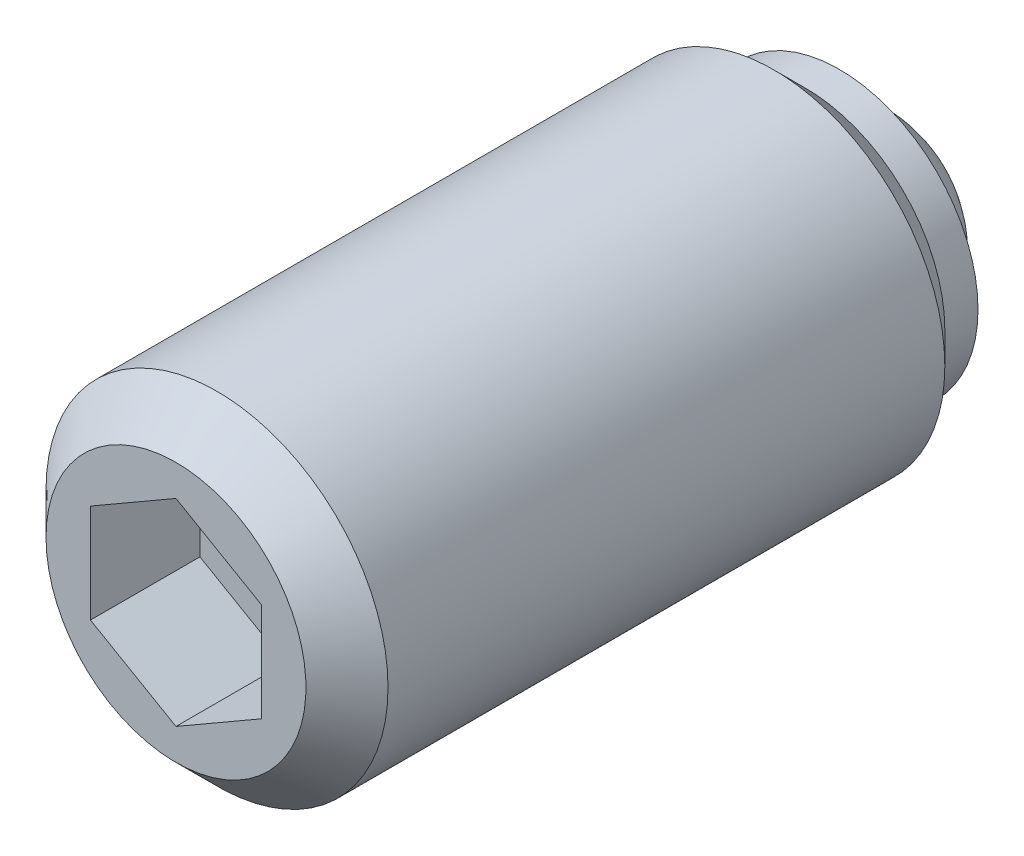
ISO-10303-21;
HEADER;
FILE_DESCRIPTION(('STEP AP214'),'2;1');
FILE_NAME('part.step','',(''),(''),'','','');
FILE_SCHEMA(('AUTOMOTIVE_DESIGN { 1 0 10303 214 1 1 1 1 }'));
ENDSEC;
DATA;
#1=APPLICATION_CONTEXT('core data for automotive mechanical design processes');
#2=APPLICATION_PROTOCOL_DEFINITION('international standard','automotive_design',2000,#1);
#3=PRODUCT_CONTEXT('',#1,'mechanical');
#4=PRODUCT('Part','Part','',(#3));
#5=PRODUCT_RELATED_PRODUCT_CATEGORY('part','',(#4));
#6=PRODUCT_DEFINITION_FORMATION('','',#4);
#7=PRODUCT_DEFINITION_CONTEXT('part definition',#1,'design');
#8=PRODUCT_DEFINITION('design','',#6,#7);
#9=PRODUCT_DEFINITION_SHAPE('','',#8);
#10=(LENGTH_UNIT() NAMED_UNIT(*) SI_UNIT(.MILLI.,.METRE.));
#11=(NAMED_UNIT(*) PLANE_ANGLE_UNIT() SI_UNIT($,.RADIAN.));
#12=(NAMED_UNIT(*) SI_UNIT($,.STERADIAN.) SOLID_ANGLE_UNIT());
#13=UNCERTAINTY_MEASURE_WITH_UNIT(LENGTH_MEASURE(1.E-05),#10,'distance_accuracy_value','');
#14=(GEOMETRIC_REPRESENTATION_CONTEXT(3) GLOBAL_UNCERTAINTY_ASSIGNED_CONTEXT((#13)) GLOBAL_UNIT_ASSIGNED_CONTEXT((#10,
#11,#12)) REPRESENTATION_CONTEXT('',''));
#15=CARTESIAN_POINT('',(0.,0.,0.));
#16=DIRECTION('',(0.,0.,1.));
#17=DIRECTION('',(1.,0.,0.));
#18=AXIS2_PLACEMENT_3D('',#15,#16,#17);
#19=CARTESIAN_POINT('',(0.,0.,18.5));
#20=DIRECTION('',(0.,0.,-1.));
#21=DIRECTION('',(-1.,0.,0.));
#22=AXIS2_PLACEMENT_3D('',#19,#20,#21);
#23=PLANE('',#22);
#24=DIRECTION('',(0.,1.,0.));
#25=VECTOR('',#24,1.);
#26=CARTESIAN_POINT('',(-2.5,-1.44337567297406,18.5));
#27=LINE('',#26,#25);
#28=CARTESIAN_POINT('',(-2.5,-1.44337567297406,18.5));
#29=VERTEX_POINT('',#28);
#30=CARTESIAN_POINT('',(-2.5,1.44337567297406,18.5));
#31=VERTEX_POINT('',#30);
#32=EDGE_CURVE('E80',#29,#31,#27,.T.);
#33=ORIENTED_EDGE('',*,*,#32,.F.);
#34=DIRECTION('',(0.866025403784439,-0.5,0.));
#35=VECTOR('',#34,1.);
#36=CARTESIAN_POINT('',(0.,-2.88675134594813,18.5));
#37=LINE('',#36,#35);
#38=CARTESIAN_POINT('',(0.,-2.88675134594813,18.5));
#39=VERTEX_POINT('',#38);
#40=EDGE_CURVE('E102',#39,#29,#37,.F.);
#41=ORIENTED_EDGE('',*,*,#40,.F.);
#42=DIRECTION('',(-0.866025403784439,-0.5,0.));
#43=VECTOR('',#42,1.);
#44=CARTESIAN_POINT('',(1.25,-2.1650635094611,18.5));
#45=LINE('',#44,#43);
#46=CARTESIAN_POINT('',(2.5,-1.44337567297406,18.5));
#47=VERTEX_POINT('',#46);
#48=EDGE_CURVE('E81',#47,#39,#45,.T.);
#49=ORIENTED_EDGE('',*,*,#48,.F.);
#50=DIRECTION('',(0.,1.,0.));
#51=VECTOR('',#50,1.);
#52=CARTESIAN_POINT('',(2.5,0.,18.5));
#53=LINE('',#52,#51);
#54=CARTESIAN_POINT('',(2.5,1.44337567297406,18.5));
#55=VERTEX_POINT('',#54);
#56=EDGE_CURVE('E64',#55,#47,#53,.F.);
#57=ORIENTED_EDGE('',*,*,#56,.F.);
#58=DIRECTION('',(0.866025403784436,-0.5,0.));
#59=VECTOR('',#58,1.);
#60=CARTESIAN_POINT('',(1.25,2.1650635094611,18.5));
#61=LINE('',#60,#59);
#62=CARTESIAN_POINT('',(0.,2.88675134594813,18.5));
#63=VERTEX_POINT('',#62);
#64=EDGE_CURVE('E67',#63,#55,#61,.T.);
#65=ORIENTED_EDGE('',*,*,#64,.F.);
#66=DIRECTION('',(0.866025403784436,0.5,0.));
#67=VECTOR('',#66,1.);
#68=CARTESIAN_POINT('',(-2.5,1.44337567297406,18.5));
#69=LINE('',#68,#67);
#70=EDGE_CURVE('E69',#31,#63,#69,.T.);
#71=ORIENTED_EDGE('',*,*,#70,.F.);
#72=EDGE_LOOP('',(#33,#41,#49,#57,#65,#71));
#73=FACE_BOUND('',#72,.T.);
#74=ADVANCED_FACE('F14',(#73),#23,.F.);
#75=CARTESIAN_POINT('',(-2.5,-1.44337567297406,18.5));
#76=DIRECTION('',(1.,0.,0.));
#77=DIRECTION('',(0.,0.,-1.));
#78=AXIS2_PLACEMENT_3D('',#75,#76,#77);
#79=PLANE('',#78);
#80=ORIENTED_EDGE('',*,*,#32,.T.);
#81=DIRECTION('',(0.,0.,-1.));
#82=VECTOR('',#81,1.);
#83=CARTESIAN_POINT('',(-2.5,1.44337567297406,18.5));
#84=LINE('',#83,#82);
#85=CARTESIAN_POINT('',(-2.5,1.44337567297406,21.7));
#86=VERTEX_POINT('',#85);
#87=EDGE_CURVE('E79',#86,#31,#84,.T.);
#88=ORIENTED_EDGE('',*,*,#87,.F.);
#89=DIRECTION('',(0.,1.,0.));
#90=VECTOR('',#89,1.);
#91=CARTESIAN_POINT('',(-2.5,0.,21.7));
#92=LINE('',#91,#90);
#93=CARTESIAN_POINT('',(-2.5,-1.44337567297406,21.7));
#94=VERTEX_POINT('',#93);
#95=EDGE_CURVE('E84',#86,#94,#92,.F.);
#96=ORIENTED_EDGE('',*,*,#95,.T.);
#97=DIRECTION('',(0.,0.,-1.));
#98=VECTOR('',#97,1.);
#99=CARTESIAN_POINT('',(-2.5,-1.44337567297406,18.5));
#100=LINE('',#99,#98);
#101=EDGE_CURVE('E96',#29,#94,#100,.F.);
#102=ORIENTED_EDGE('',*,*,#101,.F.);
#103=EDGE_LOOP('',(#80,#88,#96,#102));
#104=FACE_BOUND('',#103,.T.);
#105=ADVANCED_FACE('F169',(#104),#79,.T.);
#106=CARTESIAN_POINT('',(0.,-2.88675134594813,18.5));
#107=DIRECTION('',(0.5,0.866025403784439,0.));
#108=DIRECTION('',(0.866025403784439,-0.5,0.));
#109=AXIS2_PLACEMENT_3D('',#106,#107,#108);
#110=PLANE('',#109);
#111=ORIENTED_EDGE('',*,*,#40,.T.);
#112=ORIENTED_EDGE('',*,*,#101,.T.);
#113=DIRECTION('',(0.866025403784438,-0.5,0.));
#114=VECTOR('',#113,1.);
#115=CARTESIAN_POINT('',(-2.5,-1.44337567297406,21.7));
#116=LINE('',#115,#114);
#117=CARTESIAN_POINT('',(0.,-2.88675134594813,21.7));
#118=VERTEX_POINT('',#117);
#119=EDGE_CURVE('E85',#94,#118,#116,.T.);
#120=ORIENTED_EDGE('',*,*,#119,.T.);
#121=DIRECTION('',(0.,0.,-1.));
#122=VECTOR('',#121,1.);
#123=CARTESIAN_POINT('',(0.,-2.88675134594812,18.5));
#124=LINE('',#123,#122);
#125=EDGE_CURVE('E94',#39,#118,#124,.F.);
#126=ORIENTED_EDGE('',*,*,#125,.F.);
#127=EDGE_LOOP('',(#111,#112,#120,#126));
#128=FACE_BOUND('',#127,.T.);
#129=ADVANCED_FACE('F173',(#128),#110,.T.);
#130=CARTESIAN_POINT('',(2.5,-1.44337567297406,18.5));
#131=DIRECTION('',(-0.5,0.866025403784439,0.));
#132=DIRECTION('',(0.866025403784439,0.5,0.));
#133=AXIS2_PLACEMENT_3D('',#130,#131,#132);
#134=PLANE('',#133);
#135=ORIENTED_EDGE('',*,*,#48,.T.);
#136=ORIENTED_EDGE('',*,*,#125,.T.);
#137=DIRECTION('',(0.866025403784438,0.5,0.));
#138=VECTOR('',#137,1.);
#139=CARTESIAN_POINT('',(0.,-2.88675134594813,21.7));
#140=LINE('',#139,#138);
#141=CARTESIAN_POINT('',(2.5,-1.44337567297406,21.7));
#142=VERTEX_POINT('',#141);
#143=EDGE_CURVE('E108',#118,#142,#140,.T.);
#144=ORIENTED_EDGE('',*,*,#143,.T.);
#145=DIRECTION('',(0.,0.,1.));
#146=VECTOR('',#145,1.);
#147=CARTESIAN_POINT('',(2.5,-1.44337567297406,18.5));
#148=LINE('',#147,#146);
#149=EDGE_CURVE('E91',#47,#142,#148,.T.);
#150=ORIENTED_EDGE('',*,*,#149,.F.);
#151=EDGE_LOOP('',(#135,#136,#144,#150));
#152=FACE_BOUND('',#151,.T.);
#153=ADVANCED_FACE('F178',(#152),#134,.T.);
#154=CARTESIAN_POINT('',(2.5,1.44337567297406,18.5));
#155=DIRECTION('',(-1.,0.,0.));
#156=DIRECTION('',(0.,0.,1.));
#157=AXIS2_PLACEMENT_3D('',#154,#155,#156);
#158=PLANE('',#157);
#159=ORIENTED_EDGE('',*,*,#56,.T.);
#160=ORIENTED_EDGE('',*,*,#149,.T.);
#161=DIRECTION('',(0.,1.,0.));
#162=VECTOR('',#161,1.);
#163=CARTESIAN_POINT('',(2.5,0.,21.7));
#164=LINE('',#163,#162);
#165=CARTESIAN_POINT('',(2.5,1.44337567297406,21.7));
#166=VERTEX_POINT('',#165);
#167=EDGE_CURVE('E110',#142,#166,#164,.T.);
#168=ORIENTED_EDGE('',*,*,#167,.T.);
#169=DIRECTION('',(0.,0.,-1.));
#170=VECTOR('',#169,1.);
#171=CARTESIAN_POINT('',(2.5,1.44337567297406,18.5));
#172=LINE('',#171,#170);
#173=EDGE_CURVE('E87',#55,#166,#172,.F.);
#174=ORIENTED_EDGE('',*,*,#173,.F.);
#175=EDGE_LOOP('',(#159,#160,#168,#174));
#176=FACE_BOUND('',#175,.T.);
#177=ADVANCED_FACE('F184',(#176),#158,.T.);
#178=CARTESIAN_POINT('',(0.,2.88675134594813,18.5));
#179=DIRECTION('',(-0.5,-0.866025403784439,0.));
#180=DIRECTION('',(-0.866025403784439,0.5,0.));
#181=AXIS2_PLACEMENT_3D('',#178,#179,#180);
#182=PLANE('',#181);
#183=ORIENTED_EDGE('',*,*,#64,.T.);
#184=ORIENTED_EDGE('',*,*,#173,.T.);
#185=DIRECTION('',(-0.866025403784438,0.5,0.));
#186=VECTOR('',#185,1.);
#187=CARTESIAN_POINT('',(2.5,1.44337567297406,21.7));
#188=LINE('',#187,#186);
#189=CARTESIAN_POINT('',(0.,2.88675134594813,21.7));
#190=VERTEX_POINT('',#189);
#191=EDGE_CURVE('E31',#166,#190,#188,.T.);
#192=ORIENTED_EDGE('',*,*,#191,.T.);
#193=DIRECTION('',(0.,0.,-1.));
#194=VECTOR('',#193,1.);
#195=CARTESIAN_POINT('',(0.,2.88675134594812,18.5));
#196=LINE('',#195,#194);
#197=EDGE_CURVE('E77',#63,#190,#196,.F.);
#198=ORIENTED_EDGE('',*,*,#197,.F.);
#199=EDGE_LOOP('',(#183,#184,#192,#198));
#200=FACE_BOUND('',#199,.T.);
#201=ADVANCED_FACE('F83',(#200),#182,.T.);
#202=CARTESIAN_POINT('',(-2.5,1.44337567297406,18.5));
#203=DIRECTION('',(0.5,-0.866025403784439,0.));
#204=DIRECTION('',(-0.866025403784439,-0.5,0.));
#205=AXIS2_PLACEMENT_3D('',#202,#203,#204);
#206=PLANE('',#205);
#207=ORIENTED_EDGE('',*,*,#70,.T.);
#208=ORIENTED_EDGE('',*,*,#197,.T.);
#209=DIRECTION('',(-0.866025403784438,-0.5,0.));
#210=VECTOR('',#209,1.);
#211=CARTESIAN_POINT('',(0.,2.88675134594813,21.7));
#212=LINE('',#211,#210);
#213=EDGE_CURVE('E113',#190,#86,#212,.T.);
#214=ORIENTED_EDGE('',*,*,#213,.T.);
#215=ORIENTED_EDGE('',*,*,#87,.T.);
#216=EDGE_LOOP('',(#207,#208,#214,#215));
#217=FACE_BOUND('',#216,.T.);
#218=ADVANCED_FACE('F75',(#217),#206,.T.);
#219=CARTESIAN_POINT('',(0.,0.,21.7));
#220=DIRECTION('',(0.,0.,-1.));
#221=DIRECTION('',(-1.,0.,0.));
#222=AXIS2_PLACEMENT_3D('',#219,#220,#221);
#223=PLANE('',#222);
#224=ORIENTED_EDGE('',*,*,#191,.F.);
#225=ORIENTED_EDGE('',*,*,#167,.F.);
#226=ORIENTED_EDGE('',*,*,#143,.F.);
#227=ORIENTED_EDGE('',*,*,#119,.F.);
#228=ORIENTED_EDGE('',*,*,#95,.F.);
#229=ORIENTED_EDGE('',*,*,#213,.F.);
#230=EDGE_LOOP('',(#224,#225,#226,#227,#228,#229));
#231=FACE_BOUND('',#230,.T.);
#232=CARTESIAN_POINT('',(0.,0.,21.7));
#233=DIRECTION('',(0.,0.,-1.));
#234=DIRECTION('',(-1.,0.,0.));
#235=AXIS2_PLACEMENT_3D('',#232,#233,#234);
#236=CIRCLE('',#235,3.8000000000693);
#237=CARTESIAN_POINT('',(-3.8000000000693,0.,21.7));
#238=VERTEX_POINT('',#237);
#239=EDGE_CURVE('E17',#238,#238,#236,.T.);
#240=ORIENTED_EDGE('',*,*,#239,.F.);
#241=EDGE_LOOP('',(#240));
#242=FACE_BOUND('',#241,.T.);
#243=ADVANCED_FACE('F193',(#231,#242),#223,.F.);
#244=CARTESIAN_POINT('',(0.,0.,20.5000000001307));
#245=DIRECTION('',(0.,0.,-1.));
#246=DIRECTION('',(-1.,0.,0.));
#247=AXIS2_PLACEMENT_3D('',#244,#245,#246);
#248=CONICAL_SURFACE('',#247,4.99999999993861,0.785398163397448);
#249=ORIENTED_EDGE('',*,*,#239,.T.);
#250=EDGE_LOOP('',(#249));
#251=FACE_BOUND('',#250,.T.);
#252=CARTESIAN_POINT('',(0.,0.,20.5));
#253=DIRECTION('',(0.,0.,1.));
#254=DIRECTION('',(1.,0.,0.));
#255=AXIS2_PLACEMENT_3D('',#252,#253,#254);
#256=CIRCLE('',#255,5.);
#257=CARTESIAN_POINT('',(5.,0.,20.5));
#258=VERTEX_POINT('',#257);
#259=EDGE_CURVE('E9',#258,#258,#256,.F.);
#260=ORIENTED_EDGE('',*,*,#259,.F.);
#261=EDGE_LOOP('',(#260));
#262=FACE_BOUND('',#261,.T.);
#263=ADVANCED_FACE('F165',(#251,#262),#248,.T.);
#264=CARTESIAN_POINT('',(0.,0.,10.3));
#265=DIRECTION('',(0.,0.,1.));
#266=DIRECTION('',(1.,0.,0.));
#267=AXIS2_PLACEMENT_3D('',#264,#265,#266);
#268=CYLINDRICAL_SURFACE('',#267,5.);
#269=ORIENTED_EDGE('',*,*,#259,.T.);
#270=EDGE_LOOP('',(#269));
#271=FACE_BOUND('',#270,.T.);
#272=CARTESIAN_POINT('',(0.,0.,4.22));
#273=DIRECTION('',(0.,0.,1.));
#274=DIRECTION('',(1.,0.,0.));
#275=AXIS2_PLACEMENT_3D('',#272,#273,#274);
#276=CIRCLE('',#275,5.);
#277=CARTESIAN_POINT('',(5.,0.,4.22));
#278=VERTEX_POINT('',#277);
#279=EDGE_CURVE('E128',#278,#278,#276,.T.);
#280=ORIENTED_EDGE('',*,*,#279,.T.);
#281=EDGE_LOOP('',(#280));
#282=FACE_BOUND('',#281,.T.);
#283=ADVANCED_FACE('F132',(#271,#282),#268,.T.);
#284=CARTESIAN_POINT('',(0.,0.,3.5));
#285=DIRECTION('',(0.,0.,1.));
#286=DIRECTION('',(0.,1.,0.));
#287=AXIS2_PLACEMENT_3D('',#284,#285,#286);
#288=SPHERICAL_SURFACE('',#287,3.5);
#289=CARTESIAN_POINT('',(0.,0.,2.3));
#290=DIRECTION('',(0.,0.,1.));
#291=DIRECTION('',(1.,0.,0.));
#292=AXIS2_PLACEMENT_3D('',#289,#290,#291);
#293=CIRCLE('',#292,3.28785644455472);
#294=CARTESIAN_POINT('',(3.28785644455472,0.,2.3));
#295=VERTEX_POINT('',#294);
#296=EDGE_CURVE('E71',#295,#295,#293,.T.);
#297=ORIENTED_EDGE('',*,*,#296,.F.);
#298=EDGE_LOOP('',(#297));
#299=FACE_BOUND('',#298,.T.);
#300=ADVANCED_FACE('F155',(#299),#288,.T.);
#301=CARTESIAN_POINT('',(0.,3.28785644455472,2.3));
#302=DIRECTION('',(0.,0.,1.));
#303=DIRECTION('',(1.,0.,0.));
#304=AXIS2_PLACEMENT_3D('',#301,#302,#303);
#305=PLANE('',#304);
#306=CARTESIAN_POINT('',(0.,0.,2.3));
#307=DIRECTION('',(0.,0.,1.));
#308=DIRECTION('',(1.,0.,0.));
#309=AXIS2_PLACEMENT_3D('',#306,#307,#308);
#310=CIRCLE('',#309,4.05000000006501);
#311=CARTESIAN_POINT('',(4.05000000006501,0.,2.3));
#312=VERTEX_POINT('',#311);
#313=EDGE_CURVE('E119',#312,#312,#310,.T.);
#314=ORIENTED_EDGE('',*,*,#313,.F.);
#315=EDGE_LOOP('',(#314));
#316=FACE_BOUND('',#315,.T.);
#317=ORIENTED_EDGE('',*,*,#296,.T.);
#318=EDGE_LOOP('',(#317));
#319=FACE_BOUND('',#318,.T.);
#320=ADVANCED_FACE('F149',(#316,#319),#305,.F.);
#321=CARTESIAN_POINT('',(0.,0.,25.0345981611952));
#322=DIRECTION('',(0.,0.,1.));
#323=DIRECTION('',(1.,0.,0.));
#324=AXIS2_PLACEMENT_3D('',#321,#322,#323);
#325=CYLINDRICAL_SURFACE('',#324,4.05000000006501);
#326=CARTESIAN_POINT('',(0.,0.,3.30000000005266));
#327=DIRECTION('',(0.,0.,1.));
#328=DIRECTION('',(1.,0.,0.));
#329=AXIS2_PLACEMENT_3D('',#326,#327,#328);
#330=CIRCLE('',#329,4.05000000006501);
#331=CARTESIAN_POINT('',(4.05000000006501,0.,3.30000000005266));
#332=VERTEX_POINT('',#331);
#333=EDGE_CURVE('E122',#332,#332,#330,.T.);
#334=ORIENTED_EDGE('',*,*,#333,.F.);
#335=EDGE_LOOP('',(#334));
#336=FACE_BOUND('',#335,.T.);
#337=ORIENTED_EDGE('',*,*,#313,.T.);
#338=EDGE_LOOP('',(#337));
#339=FACE_BOUND('',#338,.T.);
#340=ADVANCED_FACE('F143',(#336,#339),#325,.T.);
#341=CARTESIAN_POINT('',(0.,4.05000000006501,3.30000000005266));
#342=DIRECTION('',(0.,0.,1.));
#343=DIRECTION('',(1.,0.,0.));
#344=AXIS2_PLACEMENT_3D('',#341,#342,#343);
#345=PLANE('',#344);
#346=CARTESIAN_POINT('',(0.,0.,3.30000000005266));
#347=DIRECTION('',(0.,0.,1.));
#348=DIRECTION('',(1.,0.,0.));
#349=AXIS2_PLACEMENT_3D('',#346,#347,#348);
#350=CIRCLE('',#349,4.08000000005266);
#351=CARTESIAN_POINT('',(4.08000000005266,0.,3.30000000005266));
#352=VERTEX_POINT('',#351);
#353=EDGE_CURVE('E125',#352,#352,#350,.T.);
#354=ORIENTED_EDGE('',*,*,#353,.F.);
#355=EDGE_LOOP('',(#354));
#356=FACE_BOUND('',#355,.T.);
#357=ORIENTED_EDGE('',*,*,#333,.T.);
#358=EDGE_LOOP('',(#357));
#359=FACE_BOUND('',#358,.T.);
#360=ADVANCED_FACE('F137',(#356,#359),#345,.F.);
#361=CARTESIAN_POINT('',(0.,0.,3.30000000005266));
#362=DIRECTION('',(0.,0.,1.));
#363=DIRECTION('',(1.,0.,0.));
#364=AXIS2_PLACEMENT_3D('',#361,#362,#363);
#365=CONICAL_SURFACE('',#364,4.08000000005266,0.785398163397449);
#366=ORIENTED_EDGE('',*,*,#279,.F.);
#367=EDGE_LOOP('',(#366));
#368=FACE_BOUND('',#367,.T.);
#369=ORIENTED_EDGE('',*,*,#353,.T.);
#370=EDGE_LOOP('',(#369));
#371=FACE_BOUND('',#370,.T.);
#372=ADVANCED_FACE('F134',(#368,#371),#365,.T.);
#373=CLOSED_SHELL('',(#74,#105,#129,#153,#177,#201,#218,#243,#263,#283,#300,#320,#340,#360,#372));
#374=MANIFOLD_SOLID_BREP('B1',#373);
#375=ADVANCED_BREP_SHAPE_REPRESENTATION('',(#18,#374),#14);
#376=SHAPE_DEFINITION_REPRESENTATION(#9,#375);
ENDSEC;
END-ISO-10303-21;
